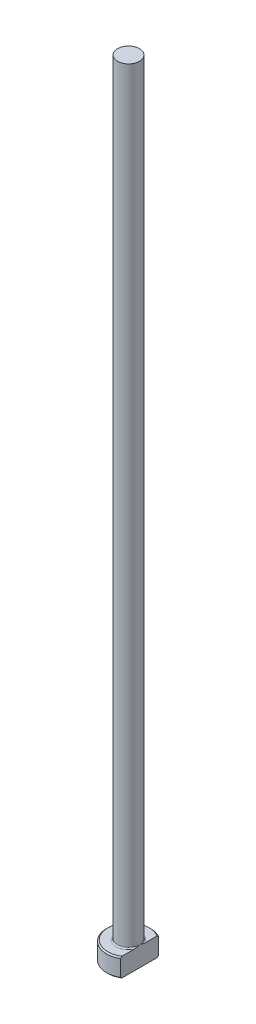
ISO-10303-21;
HEADER;
FILE_DESCRIPTION(('STEP AP214'),'2;1');
FILE_NAME('part.step','',(''),(''),'','','');
FILE_SCHEMA(('AUTOMOTIVE_DESIGN { 1 0 10303 214 1 1 1 1 }'));
ENDSEC;
DATA;
#1=APPLICATION_CONTEXT('core data for automotive mechanical design processes');
#2=APPLICATION_PROTOCOL_DEFINITION('international standard','automotive_design',2000,#1);
#3=PRODUCT_CONTEXT('',#1,'mechanical');
#4=PRODUCT('Part','Part','',(#3));
#5=PRODUCT_RELATED_PRODUCT_CATEGORY('part','',(#4));
#6=PRODUCT_DEFINITION_FORMATION('','',#4);
#7=PRODUCT_DEFINITION_CONTEXT('part definition',#1,'design');
#8=PRODUCT_DEFINITION('design','',#6,#7);
#9=PRODUCT_DEFINITION_SHAPE('','',#8);
#10=(LENGTH_UNIT() NAMED_UNIT(*) SI_UNIT(.MILLI.,.METRE.));
#11=(NAMED_UNIT(*) PLANE_ANGLE_UNIT() SI_UNIT($,.RADIAN.));
#12=(NAMED_UNIT(*) SI_UNIT($,.STERADIAN.) SOLID_ANGLE_UNIT());
#13=UNCERTAINTY_MEASURE_WITH_UNIT(LENGTH_MEASURE(1.E-05),#10,'distance_accuracy_value','');
#14=(GEOMETRIC_REPRESENTATION_CONTEXT(3) GLOBAL_UNCERTAINTY_ASSIGNED_CONTEXT((#13)) GLOBAL_UNIT_ASSIGNED_CONTEXT((#10,
#11,#12)) REPRESENTATION_CONTEXT('',''));
#15=CARTESIAN_POINT('',(0.,0.,0.));
#16=DIRECTION('',(0.,0.,1.));
#17=DIRECTION('',(1.,0.,0.));
#18=AXIS2_PLACEMENT_3D('',#15,#16,#17);
#19=CARTESIAN_POINT('',(0.,0.,0.));
#20=DIRECTION('',(0.,-1.,0.));
#21=DIRECTION('',(0.,0.,-1.));
#22=AXIS2_PLACEMENT_3D('',#19,#20,#21);
#23=PLANE('',#22);
#24=CARTESIAN_POINT('',(0.,0.,0.));
#25=DIRECTION('',(0.,-1.,0.));
#26=DIRECTION('',(0.,0.,-1.));
#27=AXIS2_PLACEMENT_3D('',#24,#25,#26);
#28=CIRCLE('',#27,3.29999999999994);
#29=CARTESIAN_POINT('',(1.74999999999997,0.,2.79776696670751));
#30=VERTEX_POINT('',#29);
#31=CARTESIAN_POINT('',(1.74999999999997,0.,-2.79776696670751));
#32=VERTEX_POINT('',#31);
#33=EDGE_CURVE('E98',#30,#32,#28,.T.);
#34=ORIENTED_EDGE('',*,*,#33,.T.);
#35=DIRECTION('',(0.,0.,1.));
#36=VECTOR('',#35,1.);
#37=CARTESIAN_POINT('',(1.74999999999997,0.,-3.03108891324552));
#38=LINE('',#37,#36);
#39=EDGE_CURVE('E83',#32,#30,#38,.T.);
#40=ORIENTED_EDGE('',*,*,#39,.T.);
#41=EDGE_LOOP('',(#34,#40));
#42=FACE_BOUND('',#41,.T.);
#43=ADVANCED_FACE('F32',(#42),#23,.T.);
#44=CARTESIAN_POINT('',(0.,259.958771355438,0.));
#45=DIRECTION('',(0.,1.,0.));
#46=DIRECTION('',(0.,0.,1.));
#47=AXIS2_PLACEMENT_3D('',#44,#45,#46);
#48=CYLINDRICAL_SURFACE('',#47,3.49999999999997);
#49=CARTESIAN_POINT('',(0.,2.80000000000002,0.));
#50=DIRECTION('',(0.,1.,0.));
#51=DIRECTION('',(0.,0.,1.));
#52=AXIS2_PLACEMENT_3D('',#49,#50,#51);
#53=CIRCLE('',#52,3.49999999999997);
#54=CARTESIAN_POINT('',(1.74999999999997,2.80000000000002,3.03108891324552));
#55=VERTEX_POINT('',#54);
#56=CARTESIAN_POINT('',(1.74999999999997,2.80000000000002,-3.03108891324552));
#57=VERTEX_POINT('',#56);
#58=EDGE_CURVE('E104',#55,#57,#53,.F.);
#59=ORIENTED_EDGE('',*,*,#58,.T.);
#60=DIRECTION('',(0.,-1.,0.));
#61=VECTOR('',#60,1.);
#62=CARTESIAN_POINT('',(1.74999999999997,125.,-3.03108891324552));
#63=LINE('',#62,#61);
#64=CARTESIAN_POINT('',(1.74999999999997,0.200000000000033,-3.03108891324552));
#65=VERTEX_POINT('',#64);
#66=EDGE_CURVE('E183',#57,#65,#63,.T.);
#67=ORIENTED_EDGE('',*,*,#66,.T.);
#68=CARTESIAN_POINT('',(0.,0.200000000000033,0.));
#69=DIRECTION('',(0.,-1.,0.));
#70=DIRECTION('',(0.,0.,-1.));
#71=AXIS2_PLACEMENT_3D('',#68,#69,#70);
#72=CIRCLE('',#71,3.49999999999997);
#73=CARTESIAN_POINT('',(1.74999999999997,0.200000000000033,3.03108891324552));
#74=VERTEX_POINT('',#73);
#75=EDGE_CURVE('E100',#65,#74,#72,.F.);
#76=ORIENTED_EDGE('',*,*,#75,.T.);
#77=DIRECTION('',(0.,-1.,0.));
#78=VECTOR('',#77,1.);
#79=CARTESIAN_POINT('',(1.74999999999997,125.,3.03108891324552));
#80=LINE('',#79,#78);
#81=EDGE_CURVE('E93',#55,#74,#80,.T.);
#82=ORIENTED_EDGE('',*,*,#81,.F.);
#83=EDGE_LOOP('',(#59,#67,#76,#82));
#84=FACE_BOUND('',#83,.T.);
#85=ADVANCED_FACE('F158',(#84),#48,.T.);
#86=CARTESIAN_POINT('',(-3.49999999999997,3.,0.));
#87=DIRECTION('',(0.,1.,0.));
#88=DIRECTION('',(0.,0.,1.));
#89=AXIS2_PLACEMENT_3D('',#86,#87,#88);
#90=PLANE('',#89);
#91=CARTESIAN_POINT('',(0.,3.,0.));
#92=DIRECTION('',(0.,1.,0.));
#93=DIRECTION('',(0.,0.,1.));
#94=AXIS2_PLACEMENT_3D('',#91,#92,#93);
#95=CIRCLE('',#94,3.29999999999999);
#96=CARTESIAN_POINT('',(1.74999999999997,3.,-2.79776696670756));
#97=VERTEX_POINT('',#96);
#98=CARTESIAN_POINT('',(1.74999999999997,3.,2.79776696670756));
#99=VERTEX_POINT('',#98);
#100=EDGE_CURVE('E178',#97,#99,#95,.T.);
#101=ORIENTED_EDGE('',*,*,#100,.T.);
#102=DIRECTION('',(0.,0.,-1.));
#103=VECTOR('',#102,1.);
#104=CARTESIAN_POINT('',(1.74999999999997,3.,0.));
#105=LINE('',#104,#103);
#106=CARTESIAN_POINT('',(1.74999999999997,2.99999999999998,0.860232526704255));
#107=VERTEX_POINT('',#106);
#108=EDGE_CURVE('E57',#99,#107,#105,.T.);
#109=ORIENTED_EDGE('',*,*,#108,.T.);
#110=CARTESIAN_POINT('',(0.,3.,0.));
#111=DIRECTION('',(0.,1.,0.));
#112=DIRECTION('',(0.,0.,1.));
#113=AXIS2_PLACEMENT_3D('',#110,#111,#112);
#114=CIRCLE('',#113,1.94999999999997);
#115=CARTESIAN_POINT('',(1.74999999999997,2.99999999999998,-0.860232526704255));
#116=VERTEX_POINT('',#115);
#117=EDGE_CURVE('E107',#107,#116,#114,.F.);
#118=ORIENTED_EDGE('',*,*,#117,.T.);
#119=EDGE_CURVE('E136',#116,#97,#105,.T.);
#120=ORIENTED_EDGE('',*,*,#119,.T.);
#121=EDGE_LOOP('',(#101,#109,#118,#120));
#122=FACE_BOUND('',#121,.T.);
#123=ADVANCED_FACE('F147',(#122),#90,.T.);
#124=CARTESIAN_POINT('',(0.,3.,0.));
#125=DIRECTION('',(0.,-1.,0.));
#126=DIRECTION('',(0.,0.,-1.));
#127=AXIS2_PLACEMENT_3D('',#124,#125,#126);
#128=CONICAL_SURFACE('',#127,3.29999999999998,0.785398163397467);
#129=ORIENTED_EDGE('',*,*,#58,.F.);
#130=CARTESIAN_POINT('',(1.74999999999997,-0.596308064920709,6.67057455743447));
#131=CARTESIAN_POINT('',(1.74999999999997,-0.450097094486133,6.51940719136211));
#132=CARTESIAN_POINT('',(1.74999999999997,-0.304043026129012,6.36808756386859));
#133=CARTESIAN_POINT('',(1.74999999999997,-0.0123415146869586,6.06505321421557));
#134=CARTESIAN_POINT('',(1.74999999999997,0.133305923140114,5.91333848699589));
#135=CARTESIAN_POINT('',(1.74999999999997,0.42417201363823,5.60934946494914));
#136=CARTESIAN_POINT('',(1.74999999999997,0.569390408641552,5.45707492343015));
#137=CARTESIAN_POINT('',(1.74999999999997,0.859185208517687,5.15191761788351));
#138=CARTESIAN_POINT('',(1.74999999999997,1.00376161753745,4.99903485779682));
#139=CARTESIAN_POINT('',(1.74999999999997,1.28922437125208,4.69552747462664));
#140=CARTESIAN_POINT('',(1.74999999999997,1.43012702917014,4.54491820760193));
#141=CARTESIAN_POINT('',(1.74999999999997,1.71087777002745,4.24272028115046));
#142=CARTESIAN_POINT('',(1.74999999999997,1.85072585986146,4.09113162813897));
#143=CARTESIAN_POINT('',(1.74999999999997,2.12895853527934,3.78667524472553));
#144=CARTESIAN_POINT('',(1.74999999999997,2.26734342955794,3.63380779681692));
#145=CARTESIAN_POINT('',(1.74999999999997,2.54209958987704,3.32627683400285));
#146=CARTESIAN_POINT('',(1.74999999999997,2.67847093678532,3.17161339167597));
#147=CARTESIAN_POINT('',(1.74999999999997,2.89617282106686,2.91990258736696));
#148=CARTESIAN_POINT('',(1.74999999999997,2.97843114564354,2.82365864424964));
#149=CARTESIAN_POINT('',(1.74999999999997,3.14148360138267,2.62991861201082));
#150=CARTESIAN_POINT('',(1.74999999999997,3.22227758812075,2.53242240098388));
#151=CARTESIAN_POINT('',(1.74999999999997,3.38274452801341,2.3347903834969));
#152=CARTESIAN_POINT('',(1.74999999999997,3.46239661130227,2.23463757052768));
#153=CARTESIAN_POINT('',(1.74999999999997,3.61891495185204,2.03220225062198));
#154=CARTESIAN_POINT('',(1.74999999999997,3.69578187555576,1.92992026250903));
#155=CARTESIAN_POINT('',(1.74999999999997,3.8466965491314,1.7209051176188));
#156=CARTESIAN_POINT('',(1.74999999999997,3.92068375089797,1.61412795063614));
#157=CARTESIAN_POINT('',(1.74999999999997,4.06269616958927,1.3963838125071));
#158=CARTESIAN_POINT('',(1.74999999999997,4.13071318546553,1.28541136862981));
#159=CARTESIAN_POINT('',(1.74999999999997,4.22516490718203,1.11561175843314));
#160=CARTESIAN_POINT('',(1.74999999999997,4.25522351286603,1.05881631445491));
#161=CARTESIAN_POINT('',(1.74999999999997,4.31237042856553,0.943756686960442));
#162=CARTESIAN_POINT('',(1.74999999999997,4.3394581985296,0.885492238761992));
#163=CARTESIAN_POINT('',(1.74999999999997,4.41499290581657,0.708569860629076));
#164=CARTESIAN_POINT('',(1.74999999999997,4.45796078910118,0.587356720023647));
#165=CARTESIAN_POINT('',(1.74999999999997,4.50447230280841,0.405622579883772));
#166=CARTESIAN_POINT('',(1.74999999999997,4.51680920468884,0.347327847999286));
#167=CARTESIAN_POINT('',(1.74999999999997,4.53592536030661,0.229813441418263));
#168=CARTESIAN_POINT('',(1.74999999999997,4.54270510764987,0.170593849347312));
#169=CARTESIAN_POINT('',(1.74999999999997,4.5502268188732,0.0519516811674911));
#170=CARTESIAN_POINT('',(1.74999999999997,4.55098747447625,-0.00746969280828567));
#171=CARTESIAN_POINT('',(1.74999999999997,4.54646541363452,-0.126082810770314));
#172=CARTESIAN_POINT('',(1.74999999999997,4.54118219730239,-0.18527453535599));
#173=CARTESIAN_POINT('',(1.74999999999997,4.52501178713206,-0.30235763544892));
#174=CARTESIAN_POINT('',(1.74999999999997,4.51417270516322,-0.360255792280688));
#175=CARTESIAN_POINT('',(1.74999999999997,4.48756668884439,-0.474896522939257));
#176=CARTESIAN_POINT('',(1.74999999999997,4.47179916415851,-0.531638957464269));
#177=CARTESIAN_POINT('',(1.74999999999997,4.43599695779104,-0.644103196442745));
#178=CARTESIAN_POINT('',(1.74999999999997,4.4159382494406,-0.69981725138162));
#179=CARTESIAN_POINT('',(1.74999999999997,4.37235913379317,-0.809843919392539));
#180=CARTESIAN_POINT('',(1.74999999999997,4.34883943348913,-0.864156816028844));
#181=CARTESIAN_POINT('',(1.74999999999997,4.27385837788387,-1.02562379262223));
#182=CARTESIAN_POINT('',(1.74999999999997,4.21814894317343,-1.13079943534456));
#183=CARTESIAN_POINT('',(1.74999999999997,4.09935726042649,-1.33694307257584));
#184=CARTESIAN_POINT('',(1.74999999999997,4.03626572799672,-1.43790554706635));
#185=CARTESIAN_POINT('',(1.74999999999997,3.90490246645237,-1.63694628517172));
#186=CARTESIAN_POINT('',(1.74999999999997,3.83661129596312,-1.73501160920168));
#187=CARTESIAN_POINT('',(1.74999999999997,3.69663576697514,-1.92859117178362));
#188=CARTESIAN_POINT('',(1.74999999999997,3.62495312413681,-2.02410666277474));
#189=CARTESIAN_POINT('',(1.74999999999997,3.47817312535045,-2.21448054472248));
#190=CARTESIAN_POINT('',(1.74999999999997,3.40304324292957,-2.30931373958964));
#191=CARTESIAN_POINT('',(1.74999999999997,3.25092223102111,-2.49748629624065));
#192=CARTESIAN_POINT('',(1.74999999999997,3.17393090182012,-2.59082549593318));
#193=CARTESIAN_POINT('',(1.74999999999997,3.0187358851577,-2.77610276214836));
#194=CARTESIAN_POINT('',(1.74999999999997,2.94053559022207,-2.86804367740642));
#195=CARTESIAN_POINT('',(1.74999999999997,2.78305359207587,-3.0509955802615));
#196=CARTESIAN_POINT('',(1.74999999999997,2.70377186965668,-3.14200655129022));
#197=CARTESIAN_POINT('',(1.74999999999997,2.49177755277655,-3.38307713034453));
#198=CARTESIAN_POINT('',(1.74999999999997,2.35832098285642,-3.53248201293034));
#199=CARTESIAN_POINT('',(1.74999999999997,2.08977689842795,-3.82982116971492));
#200=CARTESIAN_POINT('',(1.74999999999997,1.95468933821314,-3.97775540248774));
#201=CARTESIAN_POINT('',(1.74999999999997,1.68319766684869,-4.27266697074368));
#202=CARTESIAN_POINT('',(1.74999999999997,1.54679243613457,-4.41964327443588));
#203=CARTESIAN_POINT('',(1.74999999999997,1.27308598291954,-4.71275937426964));
#204=CARTESIAN_POINT('',(1.74999999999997,1.13578475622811,-4.85889916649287));
#205=CARTESIAN_POINT('',(1.74999999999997,0.734183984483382,-5.28435414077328));
#206=CARTESIAN_POINT('',(1.74999999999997,0.468971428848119,-5.56280727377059));
#207=CARTESIAN_POINT('',(1.74999999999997,0.0701049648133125,-5.97918348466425));
#208=CARTESIAN_POINT('',(1.74999999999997,-0.0629507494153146,-6.11768155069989));
#209=CARTESIAN_POINT('',(1.74999999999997,-0.32939522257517,-6.39435480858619));
#210=CARTESIAN_POINT('',(1.74999999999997,-0.462783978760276,-6.53253000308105));
#211=CARTESIAN_POINT('',(1.74999999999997,-0.596308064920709,-6.67057455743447));
#212=B_SPLINE_CURVE_WITH_KNOTS('',3,(#130,#131,#132,#133,#134,#135,#136,#137,#138,#139,#140,
#141,#142,#143,#144,#145,#146,#147,#148,#149,#150,#151,#152,#153,#154,#155,#156,#157,#158,#159,
#160,#161,#162,#163,#164,#165,#166,#167,#168,#169,#170,#171,#172,#173,#174,#175,#176,#177,#178,
#179,#180,#181,#182,#183,#184,#185,#186,#187,#188,#189,#190,#191,#192,#193,#194,#195,#196,#197,
#198,#199,#200,#201,#202,#203,#204,#205,#206,#207,#208,#209,#210,#211),.UNSPECIFIED.,.F.,.F.,(4,
2,2,2,2,2,2,2,2,2,2,2,2,2,2,2,2,2,2,2,2,2,2,2,2,2,2,2,2,2,2,2,2,2,2,2,2,2,2,2,4),(0.,
0.63092275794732,1.26185363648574,1.89310749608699,2.5243572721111,3.14308654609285,
3.76181177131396,4.38040374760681,4.99897081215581,5.37878108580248,5.75862861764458,
6.14249031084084,6.52625953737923,6.91585739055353,7.30598230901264,7.4986761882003,
7.69140503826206,8.07538783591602,8.25392686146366,8.43245002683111,8.61041858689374,
8.78840186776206,8.96486927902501,9.1413578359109,9.3188617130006,9.49632938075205,
9.8528627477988,10.209849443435,10.5682434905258,10.9264581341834,11.2893876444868,
11.6523562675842,12.014444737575,12.3765396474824,12.977513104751,13.5785034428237,
14.1800594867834,14.7816183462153,15.9352370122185,16.5114050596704,17.0875683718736),.UNSPECIFIED.);
#213=EDGE_CURVE('E135',#55,#99,#212,.T.);
#214=ORIENTED_EDGE('',*,*,#213,.T.);
#215=ORIENTED_EDGE('',*,*,#100,.F.);
#216=EDGE_CURVE('E127',#97,#57,#212,.T.);
#217=ORIENTED_EDGE('',*,*,#216,.T.);
#218=EDGE_LOOP('',(#129,#214,#215,#217));
#219=FACE_BOUND('',#218,.T.);
#220=ADVANCED_FACE('F143',(#219),#128,.T.);
#221=CARTESIAN_POINT('',(0.,0.200000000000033,0.));
#222=DIRECTION('',(0.,1.,0.));
#223=DIRECTION('',(0.,0.,1.));
#224=AXIS2_PLACEMENT_3D('',#221,#222,#223);
#225=CONICAL_SURFACE('',#224,3.49999999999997,0.78539816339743);
#226=ORIENTED_EDGE('',*,*,#75,.F.);
#227=CARTESIAN_POINT('',(1.74999999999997,3.59630806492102,-6.67057455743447));
#228=CARTESIAN_POINT('',(1.74999999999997,3.45009709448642,-6.5194071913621));
#229=CARTESIAN_POINT('',(1.74999999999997,3.30404302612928,-6.36808756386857));
#230=CARTESIAN_POINT('',(1.74999999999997,3.01234151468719,-6.06505321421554));
#231=CARTESIAN_POINT('',(1.74999999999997,2.8666940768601,-5.91333848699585));
#232=CARTESIAN_POINT('',(1.74999999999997,2.57582798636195,-5.60934946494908));
#233=CARTESIAN_POINT('',(1.74999999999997,2.43060959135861,-5.45707492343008));
#234=CARTESIAN_POINT('',(1.74999999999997,2.14081479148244,-5.15191761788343));
#235=CARTESIAN_POINT('',(1.74999999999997,1.99623838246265,-4.99903485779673));
#236=CARTESIAN_POINT('',(1.74999999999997,1.71077562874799,-4.69552747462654));
#237=CARTESIAN_POINT('',(1.74999999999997,1.56987297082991,-4.54491820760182));
#238=CARTESIAN_POINT('',(1.74999999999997,1.28912222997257,-4.24272028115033));
#239=CARTESIAN_POINT('',(1.74999999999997,1.14927414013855,-4.09113162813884));
#240=CARTESIAN_POINT('',(1.74999999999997,0.871041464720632,-3.78667524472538));
#241=CARTESIAN_POINT('',(1.74999999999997,0.732656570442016,-3.63380779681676));
#242=CARTESIAN_POINT('',(1.74999999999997,0.457900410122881,-3.32627683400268));
#243=CARTESIAN_POINT('',(1.74999999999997,0.321529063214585,-3.17161339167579));
#244=CARTESIAN_POINT('',(1.74999999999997,0.103827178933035,-2.91990258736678));
#245=CARTESIAN_POINT('',(1.74999999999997,0.0215688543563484,-2.82365864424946));
#246=CARTESIAN_POINT('',(1.74999999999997,-0.141483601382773,-2.62991861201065));
#247=CARTESIAN_POINT('',(1.74999999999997,-0.22227758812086,-2.53242240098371));
#248=CARTESIAN_POINT('',(1.74999999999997,-0.382744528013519,-2.33479038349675));
#249=CARTESIAN_POINT('',(1.74999999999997,-0.462396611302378,-2.23463757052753));
#250=CARTESIAN_POINT('',(1.74999999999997,-0.61891495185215,-2.03220225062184));
#251=CARTESIAN_POINT('',(1.74999999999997,-0.695781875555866,-1.9299202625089));
#252=CARTESIAN_POINT('',(1.74999999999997,-0.846696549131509,-1.72090511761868));
#253=CARTESIAN_POINT('',(1.74999999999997,-0.920683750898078,-1.61412795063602));
#254=CARTESIAN_POINT('',(1.74999999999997,-1.06269616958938,-1.39638381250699));
#255=CARTESIAN_POINT('',(1.74999999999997,-1.13071318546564,-1.2854113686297));
#256=CARTESIAN_POINT('',(1.74999999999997,-1.22516490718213,-1.11561175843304));
#257=CARTESIAN_POINT('',(1.74999999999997,-1.25522351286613,-1.05881631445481));
#258=CARTESIAN_POINT('',(1.74999999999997,-1.31237042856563,-0.943756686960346));
#259=CARTESIAN_POINT('',(1.74999999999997,-1.33945819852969,-0.885492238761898));
#260=CARTESIAN_POINT('',(1.74999999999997,-1.41499290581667,-0.708569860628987));
#261=CARTESIAN_POINT('',(1.74999999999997,-1.45796078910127,-0.587356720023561));
#262=CARTESIAN_POINT('',(1.74999999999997,-1.50447230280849,-0.405622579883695));
#263=CARTESIAN_POINT('',(1.74999999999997,-1.51680920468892,-0.347327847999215));
#264=CARTESIAN_POINT('',(1.74999999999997,-1.53592536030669,-0.229813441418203));
#265=CARTESIAN_POINT('',(1.74999999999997,-1.54270510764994,-0.170593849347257));
#266=CARTESIAN_POINT('',(1.74999999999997,-1.55022681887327,-0.0519516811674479));
#267=CARTESIAN_POINT('',(1.74999999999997,-1.55098747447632,0.00746969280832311));
#268=CARTESIAN_POINT('',(1.74999999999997,-1.54646541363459,0.126082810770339));
#269=CARTESIAN_POINT('',(1.74999999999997,-1.54118219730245,0.185274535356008));
#270=CARTESIAN_POINT('',(1.74999999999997,-1.52501178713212,0.302357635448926));
#271=CARTESIAN_POINT('',(1.74999999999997,-1.51417270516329,0.360255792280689));
#272=CARTESIAN_POINT('',(1.74999999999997,-1.48756668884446,0.474896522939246));
#273=CARTESIAN_POINT('',(1.74999999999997,-1.47179916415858,0.531638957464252));
#274=CARTESIAN_POINT('',(1.74999999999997,-1.43599695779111,0.644103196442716));
#275=CARTESIAN_POINT('',(1.74999999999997,-1.41593824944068,0.699817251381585));
#276=CARTESIAN_POINT('',(1.74999999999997,-1.37235913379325,0.809843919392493));
#277=CARTESIAN_POINT('',(1.74999999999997,-1.3488394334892,0.864156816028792));
#278=CARTESIAN_POINT('',(1.74999999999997,-1.27385837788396,1.02562379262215));
#279=CARTESIAN_POINT('',(1.74999999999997,-1.21814894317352,1.13079943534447));
#280=CARTESIAN_POINT('',(1.74999999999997,-1.09935726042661,1.33694307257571));
#281=CARTESIAN_POINT('',(1.74999999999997,-1.03626572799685,1.4379055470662));
#282=CARTESIAN_POINT('',(1.74999999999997,-0.904902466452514,1.63694628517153));
#283=CARTESIAN_POINT('',(1.74999999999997,-0.836611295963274,1.73501160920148));
#284=CARTESIAN_POINT('',(1.74999999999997,-0.696635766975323,1.92859117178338));
#285=CARTESIAN_POINT('',(1.74999999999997,-0.624953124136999,2.02410666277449));
#286=CARTESIAN_POINT('',(1.74999999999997,-0.478173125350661,2.2144805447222));
#287=CARTESIAN_POINT('',(1.74999999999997,-0.403043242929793,2.30931373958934));
#288=CARTESIAN_POINT('',(1.74999999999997,-0.250922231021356,2.49748629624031));
#289=CARTESIAN_POINT('',(1.74999999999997,-0.173930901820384,2.59082549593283));
#290=CARTESIAN_POINT('',(1.74999999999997,-0.0187358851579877,2.77610276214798));
#291=CARTESIAN_POINT('',(1.74999999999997,0.0594644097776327,2.86804367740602));
#292=CARTESIAN_POINT('',(1.74999999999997,0.216946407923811,3.05099558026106));
#293=CARTESIAN_POINT('',(1.74999999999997,0.296228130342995,3.14200655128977));
#294=CARTESIAN_POINT('',(1.74999999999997,0.508222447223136,3.38307713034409));
#295=CARTESIAN_POINT('',(1.74999999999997,0.64167901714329,3.53248201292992));
#296=CARTESIAN_POINT('',(1.74999999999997,0.910223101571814,3.82982116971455));
#297=CARTESIAN_POINT('',(1.74999999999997,1.04531066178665,3.97775540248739));
#298=CARTESIAN_POINT('',(1.74999999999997,1.31680233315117,4.27266697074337));
#299=CARTESIAN_POINT('',(1.74999999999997,1.45320756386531,4.41964327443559));
#300=CARTESIAN_POINT('',(1.74999999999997,1.72691401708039,4.7127593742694));
#301=CARTESIAN_POINT('',(1.74999999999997,1.86421524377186,4.85889916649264));
#302=CARTESIAN_POINT('',(1.74999999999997,2.26581601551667,5.2843541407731));
#303=CARTESIAN_POINT('',(1.74999999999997,2.53102857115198,5.56280727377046));
#304=CARTESIAN_POINT('',(1.74999999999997,2.92989503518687,5.97918348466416));
#305=CARTESIAN_POINT('',(1.74999999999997,3.06295074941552,6.11768155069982));
#306=CARTESIAN_POINT('',(1.74999999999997,3.32939522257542,6.39435480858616));
#307=CARTESIAN_POINT('',(1.74999999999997,3.46278397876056,6.53253000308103));
#308=CARTESIAN_POINT('',(1.74999999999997,3.59630806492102,6.67057455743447));
#309=B_SPLINE_CURVE_WITH_KNOTS('',3,(#227,#228,#229,#230,#231,#232,#233,#234,#235,#236,#237,
#238,#239,#240,#241,#242,#243,#244,#245,#246,#247,#248,#249,#250,#251,#252,#253,#254,#255,#256,
#257,#258,#259,#260,#261,#262,#263,#264,#265,#266,#267,#268,#269,#270,#271,#272,#273,#274,#275,
#276,#277,#278,#279,#280,#281,#282,#283,#284,#285,#286,#287,#288,#289,#290,#291,#292,#293,#294,
#295,#296,#297,#298,#299,#300,#301,#302,#303,#304,#305,#306,#307,#308),.UNSPECIFIED.,.F.,.F.,(4,
2,2,2,2,2,2,2,2,2,2,2,2,2,2,2,2,2,2,2,2,2,2,2,2,2,2,2,2,2,2,2,2,2,2,2,2,2,2,2,4),(0.,
0.630922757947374,1.26185363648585,1.89310749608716,2.52435727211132,3.14308654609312,
3.76181177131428,4.38040374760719,4.99897081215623,5.37878108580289,5.75862861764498,
6.14249031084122,6.5262595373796,6.91585739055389,7.30598230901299,7.49867618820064,
7.6914050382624,8.07538783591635,8.25392686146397,8.4324500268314,8.61041858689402,
8.78840186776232,8.96486927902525,9.14135783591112,9.3188617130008,9.49632938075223,
9.85286274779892,10.209849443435,10.5682434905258,10.9264581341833,11.2893876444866,
11.652356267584,12.0144447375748,12.3765396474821,12.9775131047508,13.5785034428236,
14.1800594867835,14.7816183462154,15.9352370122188,16.5114050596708,17.0875683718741),.UNSPECIFIED.);
#310=EDGE_CURVE('E86',#65,#32,#309,.T.);
#311=ORIENTED_EDGE('',*,*,#310,.T.);
#312=ORIENTED_EDGE('',*,*,#33,.F.);
#313=EDGE_CURVE('E89',#30,#74,#309,.T.);
#314=ORIENTED_EDGE('',*,*,#313,.T.);
#315=EDGE_LOOP('',(#226,#311,#312,#314));
#316=FACE_BOUND('',#315,.T.);
#317=ADVANCED_FACE('F97',(#316),#225,.T.);
#318=CARTESIAN_POINT('',(0.,3.19999999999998,0.));
#319=DIRECTION('',(0.,1.,0.));
#320=DIRECTION('',(0.,0.,1.));
#321=AXIS2_PLACEMENT_3D('',#318,#319,#320);
#322=TOROIDAL_SURFACE('',#321,1.94999999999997,0.2);
#323=CARTESIAN_POINT('',(1.74999999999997,3.19999999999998,0.));
#324=CARTESIAN_POINT('',(1.74999999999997,3.20000050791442,9.38679694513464E-11));
#325=CARTESIAN_POINT('',(1.74999999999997,3.20000101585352,-1.34501098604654E-07));
#326=CARTESIAN_POINT('',(1.74999999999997,3.20000198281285,-5.41283468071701E-07));
#327=CARTESIAN_POINT('',(1.74999999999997,3.20000243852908,-8.19487700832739E-07));
#328=CARTESIAN_POINT('',(1.74999999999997,3.20000335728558,-1.4843911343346E-06));
#329=CARTESIAN_POINT('',(1.74999999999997,3.20000381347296,-1.88052630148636E-06));
#330=CARTESIAN_POINT('',(1.74999999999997,3.20000466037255,-2.72280863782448E-06));
#331=CARTESIAN_POINT('',(1.74999999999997,3.20000505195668,-3.16812551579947E-06));
#332=CARTESIAN_POINT('',(1.74999999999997,3.20000641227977,-4.80772278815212E-06));
#333=CARTESIAN_POINT('',(1.74999999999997,3.20000730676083,-6.06508167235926E-06));
#334=CARTESIAN_POINT('',(1.74999999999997,3.20000885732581,-8.62364306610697E-06));
#335=CARTESIAN_POINT('',(1.74999999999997,3.20000952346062,-9.91907764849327E-06));
#336=CARTESIAN_POINT('',(1.74999999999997,3.20001212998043,-1.51310765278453E-05));
#337=CARTESIAN_POINT('',(1.74999999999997,3.20001395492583,-1.91092654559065E-05));
#338=CARTESIAN_POINT('',(1.74999999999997,3.2000168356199,-2.68327805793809E-05));
#339=CARTESIAN_POINT('',(1.74999999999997,3.20001795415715,-3.05551299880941E-05));
#340=CARTESIAN_POINT('',(1.74999999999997,3.20002287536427,-4.68261372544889E-05));
#341=CARTESIAN_POINT('',(1.74999999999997,3.20002674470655,-5.93446276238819E-05));
#342=CARTESIAN_POINT('',(1.74999999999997,3.20003278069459,-8.25255939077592E-05));
#343=CARTESIAN_POINT('',(1.74999999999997,3.20003512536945,-9.31393220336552E-05));
#344=CARTESIAN_POINT('',(1.74999999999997,3.20005413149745,-0.00017197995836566));
#345=CARTESIAN_POINT('',(1.74999999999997,3.20007897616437,-0.000237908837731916));
#346=CARTESIAN_POINT('',(1.74999999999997,3.20017305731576,-0.000496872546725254));
#347=CARTESIAN_POINT('',(1.74999999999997,3.20023617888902,-0.00069150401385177));
#348=CARTESIAN_POINT('',(1.74999999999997,3.20048774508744,-0.00145613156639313));
#349=CARTESIAN_POINT('',(1.74999999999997,3.20068259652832,-0.00202450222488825));
#350=CARTESIAN_POINT('',(1.74999999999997,3.20148279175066,-0.0043694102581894));
#351=CARTESIAN_POINT('',(1.74999999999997,3.20208089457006,-0.00614773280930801));
#352=CARTESIAN_POINT('',(1.74999999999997,3.20853845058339,-0.0253339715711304));
#353=CARTESIAN_POINT('',(1.74999999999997,3.21443574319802,-0.0427328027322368));
#354=CARTESIAN_POINT('',(1.74999999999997,3.22594434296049,-0.0768841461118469));
#355=CARTESIAN_POINT('',(1.74999999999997,3.2315579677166,-0.0936359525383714));
#356=CARTESIAN_POINT('',(1.74999999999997,3.24339960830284,-0.129193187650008));
#357=CARTESIAN_POINT('',(1.74999999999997,3.24961959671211,-0.148001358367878));
#358=CARTESIAN_POINT('',(1.74999999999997,3.26199268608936,-0.185858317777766));
#359=CARTESIAN_POINT('',(1.74999999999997,3.26814439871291,-0.204907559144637));
#360=CARTESIAN_POINT('',(1.74999999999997,3.28302129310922,-0.251728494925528));
#361=CARTESIAN_POINT('',(1.74999999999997,3.29164632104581,-0.279532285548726));
#362=CARTESIAN_POINT('',(1.74999999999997,3.30815507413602,-0.334622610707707));
#363=CARTESIAN_POINT('',(1.74999999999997,3.31605173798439,-0.361905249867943));
#364=CARTESIAN_POINT('',(1.74999999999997,3.33270110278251,-0.422187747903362));
#365=CARTESIAN_POINT('',(1.74999999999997,3.34130455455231,-0.4552293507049));
#366=CARTESIAN_POINT('',(1.74999999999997,3.35728256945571,-0.521873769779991));
#367=CARTESIAN_POINT('',(1.74999999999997,3.36464748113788,-0.555478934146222));
#368=CARTESIAN_POINT('',(1.74999999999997,3.37810121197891,-0.62522543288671));
#369=CARTESIAN_POINT('',(1.74999999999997,3.38407559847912,-0.661389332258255));
#370=CARTESIAN_POINT('',(1.74999999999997,3.39348021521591,-0.733973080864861));
#371=CARTESIAN_POINT('',(1.74999999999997,3.39691695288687,-0.770392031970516));
#372=CARTESIAN_POINT('',(1.74999999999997,3.39990626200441,-0.832262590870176));
#373=CARTESIAN_POINT('',(1.74999999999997,3.40032395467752,-0.85767040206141));
#374=CARTESIAN_POINT('',(1.74999999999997,3.39916217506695,-0.908260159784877));
#375=CARTESIAN_POINT('',(1.74999999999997,3.39759783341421,-0.933442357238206));
#376=CARTESIAN_POINT('',(1.74999999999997,3.39129859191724,-0.989903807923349));
#377=CARTESIAN_POINT('',(1.74999999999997,3.38586007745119,-1.02110925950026));
#378=CARTESIAN_POINT('',(1.74999999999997,3.36964168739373,-1.08216800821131));
#379=CARTESIAN_POINT('',(1.74999999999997,3.35888918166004,-1.11202738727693));
#380=CARTESIAN_POINT('',(1.74999999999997,3.33961802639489,-1.14878048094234));
#381=CARTESIAN_POINT('',(1.74999999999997,3.33455492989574,-1.15748014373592));
#382=CARTESIAN_POINT('',(1.74999999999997,3.32351587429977,-1.1742966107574));
#383=CARTESIAN_POINT('',(1.74999999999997,3.31753946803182,-1.18241312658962));
#384=CARTESIAN_POINT('',(1.74999999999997,3.30451428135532,-1.19787793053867));
#385=CARTESIAN_POINT('',(1.74999999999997,3.29745609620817,-1.20521842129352));
#386=CARTESIAN_POINT('',(1.74999999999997,3.2822352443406,-1.21865698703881));
#387=CARTESIAN_POINT('',(1.74999999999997,3.27407476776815,-1.22475746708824));
#388=CARTESIAN_POINT('',(1.74999999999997,3.25920166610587,-1.23370537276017));
#389=CARTESIAN_POINT('',(1.74999999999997,3.25274944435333,-1.23698363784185));
#390=CARTESIAN_POINT('',(1.74999999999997,3.23939659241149,-1.24245066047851));
#391=CARTESIAN_POINT('',(1.74999999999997,3.23249637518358,-1.2446404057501));
#392=CARTESIAN_POINT('',(1.74999999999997,3.21836445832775,-1.24776583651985));
#393=CARTESIAN_POINT('',(1.74999999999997,3.21113087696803,-1.24869317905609));
#394=CARTESIAN_POINT('',(1.74999999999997,3.19661788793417,-1.24917680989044));
#395=CARTESIAN_POINT('',(1.74999999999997,3.18933848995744,-1.2487333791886));
#396=CARTESIAN_POINT('',(1.74999999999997,3.17564813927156,-1.2466228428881));
#397=CARTESIAN_POINT('',(1.74999999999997,3.16921873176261,-1.24507159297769));
#398=CARTESIAN_POINT('',(1.74999999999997,3.1566813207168,-1.24099086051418));
#399=CARTESIAN_POINT('',(1.74999999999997,3.15057343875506,-1.23846101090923));
#400=CARTESIAN_POINT('',(1.74999999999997,3.13656990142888,-1.23147130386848));
#401=CARTESIAN_POINT('',(1.74999999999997,3.1288582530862,-1.2266435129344));
#402=CARTESIAN_POINT('',(1.74999999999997,3.11430996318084,-1.21581214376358));
#403=CARTESIAN_POINT('',(1.74999999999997,3.10747539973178,-1.20980585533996));
#404=CARTESIAN_POINT('',(1.74999999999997,3.09141283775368,-1.19367262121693));
#405=CARTESIAN_POINT('',(1.74999999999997,3.0827335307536,-1.18300273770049));
#406=CARTESIAN_POINT('',(1.74999999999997,3.06710756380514,-1.16049397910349));
#407=CARTESIAN_POINT('',(1.74999999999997,3.06016260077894,-1.14865397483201));
#408=CARTESIAN_POINT('',(1.74999999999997,3.04314403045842,-1.11526045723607));
#409=CARTESIAN_POINT('',(1.74999999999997,3.03452872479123,-1.09297031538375));
#410=CARTESIAN_POINT('',(1.74999999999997,3.0205187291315,-1.04724849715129));
#411=CARTESIAN_POINT('',(1.74999999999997,3.01515578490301,-1.02380790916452));
#412=CARTESIAN_POINT('',(1.74999999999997,3.00698483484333,-0.976403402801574));
#413=CARTESIAN_POINT('',(1.74999999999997,3.00418732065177,-0.952437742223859));
#414=CARTESIAN_POINT('',(1.74999999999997,3.00064912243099,-0.9043219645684));
#415=CARTESIAN_POINT('',(1.74999999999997,2.99991269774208,-0.880171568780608));
#416=CARTESIAN_POINT('',(1.74999999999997,3.00019275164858,-0.809643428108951));
#417=CARTESIAN_POINT('',(1.74999999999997,3.00344813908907,-0.763278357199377));
#418=CARTESIAN_POINT('',(1.74999999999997,3.01492484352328,-0.664825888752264));
#419=CARTESIAN_POINT('',(1.74999999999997,3.02376250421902,-0.612819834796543));
#420=CARTESIAN_POINT('',(1.74999999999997,3.04538488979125,-0.508370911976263));
#421=CARTESIAN_POINT('',(1.74999999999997,3.0582587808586,-0.455947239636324));
#422=CARTESIAN_POINT('',(1.74999999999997,3.08196429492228,-0.368604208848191));
#423=CARTESIAN_POINT('',(1.74999999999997,3.09211504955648,-0.333493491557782));
#424=CARTESIAN_POINT('',(1.74999999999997,3.11312724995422,-0.263893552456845));
#425=CARTESIAN_POINT('',(1.74999999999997,3.12397997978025,-0.229401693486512));
#426=CARTESIAN_POINT('',(1.74999999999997,3.1449667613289,-0.164340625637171));
#427=CARTESIAN_POINT('',(1.74999999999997,3.15504975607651,-0.133754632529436));
#428=CARTESIAN_POINT('',(1.74999999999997,3.17587821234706,-0.071424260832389));
#429=CARTESIAN_POINT('',(1.74999999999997,3.18663395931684,-0.0396831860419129));
#430=CARTESIAN_POINT('',(1.74999999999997,3.19791979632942,-0.0061453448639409));
#431=CARTESIAN_POINT('',(1.74999999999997,3.1985187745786,-0.00436467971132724));
#432=CARTESIAN_POINT('',(1.74999999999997,3.19931918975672,-0.00201922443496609));
#433=CARTESIAN_POINT('',(1.74999999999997,3.1995134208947,-0.00145265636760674));
#434=CARTESIAN_POINT('',(1.74999999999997,3.19976423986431,-0.000690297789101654));
#435=CARTESIAN_POINT('',(1.74999999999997,3.19982721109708,-0.000496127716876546));
#436=CARTESIAN_POINT('',(1.74999999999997,3.19992109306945,-0.000237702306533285));
#437=CARTESIAN_POINT('',(1.74999999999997,3.19994590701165,-0.000171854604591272));
#438=CARTESIAN_POINT('',(1.74999999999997,3.19996489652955,-9.31045536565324E-05));
#439=CARTESIAN_POINT('',(1.74999999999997,3.19996724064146,-8.24963335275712E-05));
#440=CARTESIAN_POINT('',(1.74999999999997,3.19997327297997,-5.93277760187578E-05));
#441=CARTESIAN_POINT('',(1.74999999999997,3.1999771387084,-4.68160427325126E-05));
#442=CARTESIAN_POINT('',(1.74999999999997,3.19998205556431,-3.05525841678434E-05));
#443=CARTESIAN_POINT('',(1.74999999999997,3.19998317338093,-2.68310310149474E-05));
#444=CARTESIAN_POINT('',(1.74999999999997,3.19998605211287,-1.91090650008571E-05));
#445=CARTESIAN_POINT('',(1.74999999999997,3.19998787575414,-1.51315953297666E-05));
#446=CARTESIAN_POINT('',(1.74999999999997,3.19999048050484,-9.92029969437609E-06));
#447=CARTESIAN_POINT('',(1.74999999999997,3.19999114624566,-8.62492588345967E-06));
#448=CARTESIAN_POINT('',(1.74999999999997,3.19999269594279,-6.06641152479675E-06));
#449=CARTESIAN_POINT('',(1.74999999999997,3.19999358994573,-4.80903333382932E-06));
#450=CARTESIAN_POINT('',(1.74999999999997,3.19999494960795,-3.16932189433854E-06));
#451=CARTESIAN_POINT('',(1.74999999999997,3.19999534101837,-2.72395382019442E-06));
#452=CARTESIAN_POINT('',(1.74999999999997,3.19999618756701,-1.88153780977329E-06));
#453=CARTESIAN_POINT('',(1.74999999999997,3.19999664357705,-1.48531958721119E-06));
#454=CARTESIAN_POINT('',(1.74999999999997,3.1999975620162,-8.20216861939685E-07));
#455=CARTESIAN_POINT('',(1.74999999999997,3.19999801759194,-5.41901808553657E-07));
#456=CARTESIAN_POINT('',(1.74999999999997,3.19999898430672,-1.34847126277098E-07));
#457=CARTESIAN_POINT('',(1.74999999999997,3.19999949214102,-9.38577158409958E-11));
#458=CARTESIAN_POINT('',(1.74999999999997,3.19999999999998,0.));
#459=B_SPLINE_CURVE_WITH_KNOTS('',3,(#323,#324,#325,#326,#327,#328,#329,#330,#331,#332,#333,
#334,#335,#336,#337,#338,#339,#340,#341,#342,#343,#344,#345,#346,#347,#348,#349,#350,#351,#352,
#353,#354,#355,#356,#357,#358,#359,#360,#361,#362,#363,#364,#365,#366,#367,#368,#369,#370,#371,
#372,#373,#374,#375,#376,#377,#378,#379,#380,#381,#382,#383,#384,#385,#386,#387,#388,#389,#390,
#391,#392,#393,#394,#395,#396,#397,#398,#399,#400,#401,#402,#403,#404,#405,#406,#407,#408,#409,
#410,#411,#412,#413,#414,#415,#416,#417,#418,#419,#420,#421,#422,#423,#424,#425,#426,#427,#428,
#429,#430,#431,#432,#433,#434,#435,#436,#437,#438,#439,#440,#441,#442,#443,#444,#445,#446,#447,
#448,#449,#450,#451,#452,#453,#454,#455,#456,#457,#458),.UNSPECIFIED.,.T.,.F.,(4,2,2,2,2,2,2,2,
2,2,2,2,2,2,2,2,2,2,2,2,2,2,2,2,2,2,2,2,2,2,2,2,2,2,2,2,2,2,2,2,2,2,2,2,2,2,2,2,2,2,2,2,2,2,2,2,
2,2,2,2,2,2,2,2,2,2,2,4),(0.,1.52538207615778E-06,3.12059533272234E-06,4.92466458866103E-06,
6.70193593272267E-06,1.13103009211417E-05,1.56767125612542E-05,2.8774065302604E-05,
4.0421459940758E-05,7.97265134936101E-05,0.00011230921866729,0.000323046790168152,
0.000937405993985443,0.0027392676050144,0.00836862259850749,0.0634773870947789,
0.116480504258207,0.175909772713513,0.235963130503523,0.32329152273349,0.408492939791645,
0.510903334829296,0.614078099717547,0.723976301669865,0.833591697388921,0.909765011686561,
0.985360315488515,1.08013194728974,1.1744204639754,1.20457287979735,1.23474010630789,
1.26518627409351,1.29557281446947,1.3172031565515,1.33881383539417,1.36056665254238,
1.38231501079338,1.40207044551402,1.42183329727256,1.44897527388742,1.47618041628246,
1.51721056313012,1.55828069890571,1.62957223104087,1.70154887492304,1.77381858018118,
1.84623752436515,1.98535010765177,2.1434225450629,2.30526751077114,2.41490365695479,
2.52337268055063,2.61998889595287,2.72052170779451,2.72615854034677,2.72795468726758,
2.72856758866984,2.72877806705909,2.72881063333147,2.72884991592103,2.7288615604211,
2.72887465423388,2.72887901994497,2.72888362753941,2.72888540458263,2.72888720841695,
2.72888880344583,2.72889032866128),.UNSPECIFIED.);
#460=CARTESIAN_POINT('',(1.74999999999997,3.19999999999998,0.));
#461=VERTEX_POINT('',#460);
#462=EDGE_CURVE('E11',#116,#461,#459,.T.);
#463=ORIENTED_EDGE('',*,*,#462,.F.);
#464=ORIENTED_EDGE('',*,*,#117,.F.);
#465=CARTESIAN_POINT('',(1.74999999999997,3.19999999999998,0.));
#466=CARTESIAN_POINT('',(1.74999999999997,3.19999949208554,-9.38679203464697E-11));
#467=CARTESIAN_POINT('',(1.74999999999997,3.19999898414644,1.34501098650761E-07));
#468=CARTESIAN_POINT('',(1.74999999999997,3.19999801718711,5.41283468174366E-07));
#469=CARTESIAN_POINT('',(1.74999999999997,3.19999756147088,8.1948770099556E-07));
#470=CARTESIAN_POINT('',(1.74999999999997,3.19999664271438,1.48439113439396E-06));
#471=CARTESIAN_POINT('',(1.74999999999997,3.19999618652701,1.88052630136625E-06));
#472=CARTESIAN_POINT('',(1.74999999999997,3.19999533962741,2.72280863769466E-06));
#473=CARTESIAN_POINT('',(1.74999999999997,3.19999494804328,3.16812551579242E-06));
#474=CARTESIAN_POINT('',(1.74999999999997,3.1999935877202,4.80772278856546E-06));
#475=CARTESIAN_POINT('',(1.74999999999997,3.19999269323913,6.06508167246E-06));
#476=CARTESIAN_POINT('',(1.74999999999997,3.19999114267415,8.62364306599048E-06));
#477=CARTESIAN_POINT('',(1.74999999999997,3.19999047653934,9.91907764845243E-06));
#478=CARTESIAN_POINT('',(1.74999999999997,3.19998787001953,1.51310765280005E-05));
#479=CARTESIAN_POINT('',(1.74999999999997,3.19998604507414,1.91092654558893E-05));
#480=CARTESIAN_POINT('',(1.74999999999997,3.19998316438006,2.68327805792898E-05));
#481=CARTESIAN_POINT('',(1.74999999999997,3.19998204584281,3.05551299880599E-05));
#482=CARTESIAN_POINT('',(1.74999999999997,3.19997712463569,4.68261372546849E-05));
#483=CARTESIAN_POINT('',(1.74999999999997,3.19997325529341,5.93446276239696E-05));
#484=CARTESIAN_POINT('',(1.74999999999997,3.19996721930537,8.25255939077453E-05));
#485=CARTESIAN_POINT('',(1.74999999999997,3.19996487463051,9.3139322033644E-05));
#486=CARTESIAN_POINT('',(1.74999999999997,3.19994586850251,0.000171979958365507));
#487=CARTESIAN_POINT('',(1.74999999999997,3.19992102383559,0.000237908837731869));
#488=CARTESIAN_POINT('',(1.74999999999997,3.1998269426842,0.000496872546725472));
#489=CARTESIAN_POINT('',(1.74999999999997,3.19976382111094,0.000691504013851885));
#490=CARTESIAN_POINT('',(1.74999999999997,3.19951225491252,0.00145613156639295));
#491=CARTESIAN_POINT('',(1.74999999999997,3.19931740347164,0.00202450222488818));
#492=CARTESIAN_POINT('',(1.74999999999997,3.1985172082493,0.00436941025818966));
#493=CARTESIAN_POINT('',(1.74999999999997,3.1979191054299,0.00614773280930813));
#494=CARTESIAN_POINT('',(1.74999999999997,3.19146154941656,0.0253339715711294));
#495=CARTESIAN_POINT('',(1.74999999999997,3.18556425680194,0.0427328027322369));
#496=CARTESIAN_POINT('',(1.74999999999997,3.17405565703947,0.0768841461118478));
#497=CARTESIAN_POINT('',(1.74999999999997,3.16844203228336,0.0936359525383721));
#498=CARTESIAN_POINT('',(1.74999999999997,3.15660039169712,0.129193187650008));
#499=CARTESIAN_POINT('',(1.74999999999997,3.15038040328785,0.148001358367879));
#500=CARTESIAN_POINT('',(1.74999999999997,3.1380073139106,0.185858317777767));
#501=CARTESIAN_POINT('',(1.74999999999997,3.13185560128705,0.204907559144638));
#502=CARTESIAN_POINT('',(1.74999999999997,3.11697870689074,0.251728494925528));
#503=CARTESIAN_POINT('',(1.74999999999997,3.10835367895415,0.279532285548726));
#504=CARTESIAN_POINT('',(1.74999999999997,3.09184492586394,0.334622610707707));
#505=CARTESIAN_POINT('',(1.74999999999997,3.08394826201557,0.361905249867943));
#506=CARTESIAN_POINT('',(1.74999999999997,3.06729889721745,0.422187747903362));
#507=CARTESIAN_POINT('',(1.74999999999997,3.05869544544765,0.4552293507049));
#508=CARTESIAN_POINT('',(1.74999999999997,3.04271743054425,0.521873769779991));
#509=CARTESIAN_POINT('',(1.74999999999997,3.03535251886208,0.555478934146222));
#510=CARTESIAN_POINT('',(1.74999999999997,3.02189878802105,0.62522543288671));
#511=CARTESIAN_POINT('',(1.74999999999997,3.01592440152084,0.661389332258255));
#512=CARTESIAN_POINT('',(1.74999999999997,3.00651978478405,0.733973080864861));
#513=CARTESIAN_POINT('',(1.74999999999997,3.00308304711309,0.770392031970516));
#514=CARTESIAN_POINT('',(1.74999999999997,3.00009373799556,0.832262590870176));
#515=CARTESIAN_POINT('',(1.74999999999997,2.99967604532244,0.85767040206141));
#516=CARTESIAN_POINT('',(1.74999999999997,3.00083782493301,0.908260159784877));
#517=CARTESIAN_POINT('',(1.74999999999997,3.00240216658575,0.933442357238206));
#518=CARTESIAN_POINT('',(1.74999999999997,3.00870140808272,0.989903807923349));
#519=CARTESIAN_POINT('',(1.74999999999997,3.01413992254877,1.02110925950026));
#520=CARTESIAN_POINT('',(1.74999999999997,3.03035831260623,1.08216800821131));
#521=CARTESIAN_POINT('',(1.74999999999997,3.04111081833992,1.11202738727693));
#522=CARTESIAN_POINT('',(1.74999999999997,3.06038197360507,1.14878048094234));
#523=CARTESIAN_POINT('',(1.74999999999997,3.06544507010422,1.15748014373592));
#524=CARTESIAN_POINT('',(1.74999999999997,3.07648412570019,1.1742966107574));
#525=CARTESIAN_POINT('',(1.74999999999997,3.08246053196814,1.18241312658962));
#526=CARTESIAN_POINT('',(1.74999999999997,3.09548571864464,1.19787793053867));
#527=CARTESIAN_POINT('',(1.74999999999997,3.10254390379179,1.20521842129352));
#528=CARTESIAN_POINT('',(1.74999999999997,3.11776475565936,1.21865698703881));
#529=CARTESIAN_POINT('',(1.74999999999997,3.12592523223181,1.22475746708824));
#530=CARTESIAN_POINT('',(1.74999999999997,3.14079833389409,1.23370537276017));
#531=CARTESIAN_POINT('',(1.74999999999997,3.14725055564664,1.23698363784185));
#532=CARTESIAN_POINT('',(1.74999999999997,3.16060340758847,1.24245066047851));
#533=CARTESIAN_POINT('',(1.74999999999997,3.16750362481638,1.2446404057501));
#534=CARTESIAN_POINT('',(1.74999999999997,3.18163554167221,1.24776583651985));
#535=CARTESIAN_POINT('',(1.74999999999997,3.18886912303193,1.24869317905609));
#536=CARTESIAN_POINT('',(1.74999999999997,3.20338211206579,1.24917680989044));
#537=CARTESIAN_POINT('',(1.74999999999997,3.21066151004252,1.2487333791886));
#538=CARTESIAN_POINT('',(1.74999999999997,3.2243518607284,1.2466228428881));
#539=CARTESIAN_POINT('',(1.74999999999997,3.23078126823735,1.24507159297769));
#540=CARTESIAN_POINT('',(1.74999999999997,3.24331867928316,1.24099086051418));
#541=CARTESIAN_POINT('',(1.74999999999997,3.2494265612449,1.23846101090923));
#542=CARTESIAN_POINT('',(1.74999999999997,3.26343009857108,1.23147130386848));
#543=CARTESIAN_POINT('',(1.74999999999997,3.27114174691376,1.2266435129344));
#544=CARTESIAN_POINT('',(1.74999999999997,3.28569003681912,1.21581214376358));
#545=CARTESIAN_POINT('',(1.74999999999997,3.29252460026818,1.20980585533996));
#546=CARTESIAN_POINT('',(1.74999999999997,3.30858716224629,1.19367262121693));
#547=CARTESIAN_POINT('',(1.74999999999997,3.31726646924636,1.18300273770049));
#548=CARTESIAN_POINT('',(1.74999999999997,3.33289243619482,1.16049397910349));
#549=CARTESIAN_POINT('',(1.74999999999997,3.33983739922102,1.14865397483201));
#550=CARTESIAN_POINT('',(1.74999999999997,3.35685596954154,1.11526045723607));
#551=CARTESIAN_POINT('',(1.74999999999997,3.36547127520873,1.09297031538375));
#552=CARTESIAN_POINT('',(1.74999999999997,3.37948127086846,1.04724849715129));
#553=CARTESIAN_POINT('',(1.74999999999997,3.38484421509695,1.02380790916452));
#554=CARTESIAN_POINT('',(1.74999999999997,3.39301516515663,0.976403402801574));
#555=CARTESIAN_POINT('',(1.74999999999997,3.39581267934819,0.952437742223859));
#556=CARTESIAN_POINT('',(1.74999999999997,3.39935087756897,0.9043219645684));
#557=CARTESIAN_POINT('',(1.74999999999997,3.40008730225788,0.880171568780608));
#558=CARTESIAN_POINT('',(1.74999999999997,3.39980724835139,0.809643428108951));
#559=CARTESIAN_POINT('',(1.74999999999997,3.3965518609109,0.763278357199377));
#560=CARTESIAN_POINT('',(1.74999999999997,3.38507515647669,0.664825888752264));
#561=CARTESIAN_POINT('',(1.74999999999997,3.37623749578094,0.612819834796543));
#562=CARTESIAN_POINT('',(1.74999999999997,3.35461511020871,0.508370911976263));
#563=CARTESIAN_POINT('',(1.74999999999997,3.34174121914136,0.455947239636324));
#564=CARTESIAN_POINT('',(1.74999999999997,3.31803570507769,0.368604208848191));
#565=CARTESIAN_POINT('',(1.74999999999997,3.30788495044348,0.333493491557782));
#566=CARTESIAN_POINT('',(1.74999999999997,3.28687275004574,0.263893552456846));
#567=CARTESIAN_POINT('',(1.74999999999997,3.27602002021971,0.229401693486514));
#568=CARTESIAN_POINT('',(1.74999999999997,3.25503323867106,0.164340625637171));
#569=CARTESIAN_POINT('',(1.74999999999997,3.24495024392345,0.133754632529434));
#570=CARTESIAN_POINT('',(1.74999999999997,3.22412178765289,0.0714242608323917));
#571=CARTESIAN_POINT('',(1.74999999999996,3.21336604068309,0.0396831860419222));
#572=CARTESIAN_POINT('',(1.74999999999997,3.20208020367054,0.00614534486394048));
#573=CARTESIAN_POINT('',(1.74999999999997,3.20148122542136,0.00436467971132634));
#574=CARTESIAN_POINT('',(1.74999999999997,3.20068081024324,0.00201922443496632));
#575=CARTESIAN_POINT('',(1.74999999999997,3.20048657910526,0.00145265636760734));
#576=CARTESIAN_POINT('',(1.74999999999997,3.20023576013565,0.000690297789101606));
#577=CARTESIAN_POINT('',(1.74999999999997,3.20017278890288,0.000496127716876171));
#578=CARTESIAN_POINT('',(1.74999999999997,3.20007890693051,0.000237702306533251));
#579=CARTESIAN_POINT('',(1.74999999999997,3.20005409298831,0.000171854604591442));
#580=CARTESIAN_POINT('',(1.74999999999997,3.20003510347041,9.3104553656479E-05));
#581=CARTESIAN_POINT('',(1.74999999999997,3.20003275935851,8.24963335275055E-05));
#582=CARTESIAN_POINT('',(1.74999999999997,3.20002672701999,5.93277760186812E-05));
#583=CARTESIAN_POINT('',(1.74999999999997,3.20002286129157,4.68160427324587E-05));
#584=CARTESIAN_POINT('',(1.74999999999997,3.20001794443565,3.05525841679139E-05));
#585=CARTESIAN_POINT('',(1.74999999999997,3.20001682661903,2.6831031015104E-05));
#586=CARTESIAN_POINT('',(1.74999999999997,3.20001394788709,1.91090650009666E-05));
#587=CARTESIAN_POINT('',(1.74999999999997,3.20001212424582,1.51315953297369E-05));
#588=CARTESIAN_POINT('',(1.74999999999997,3.20000951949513,9.92029969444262E-06));
#589=CARTESIAN_POINT('',(1.74999999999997,3.2000088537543,8.62492588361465E-06));
#590=CARTESIAN_POINT('',(1.74999999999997,3.20000730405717,6.06641152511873E-06));
#591=CARTESIAN_POINT('',(1.74999999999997,3.20000641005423,4.80903333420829E-06));
#592=CARTESIAN_POINT('',(1.74999999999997,3.20000505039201,3.16932189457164E-06));
#593=CARTESIAN_POINT('',(1.74999999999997,3.2000046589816,2.72395382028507E-06));
#594=CARTESIAN_POINT('',(1.74999999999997,3.20000381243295,1.88153780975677E-06));
#595=CARTESIAN_POINT('',(1.74999999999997,3.20000335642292,1.48531958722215E-06));
#596=CARTESIAN_POINT('',(1.74999999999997,3.20000243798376,8.20216861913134E-07));
#597=CARTESIAN_POINT('',(1.74999999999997,3.20000198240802,5.41901808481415E-07));
#598=CARTESIAN_POINT('',(1.74999999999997,3.20000101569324,1.3484712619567E-07));
#599=CARTESIAN_POINT('',(1.74999999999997,3.20000050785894,9.38576667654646E-11));
#600=CARTESIAN_POINT('',(1.74999999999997,3.19999999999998,0.));
#601=B_SPLINE_CURVE_WITH_KNOTS('',3,(#465,#466,#467,#468,#469,#470,#471,#472,#473,#474,#475,
#476,#477,#478,#479,#480,#481,#482,#483,#484,#485,#486,#487,#488,#489,#490,#491,#492,#493,#494,
#495,#496,#497,#498,#499,#500,#501,#502,#503,#504,#505,#506,#507,#508,#509,#510,#511,#512,#513,
#514,#515,#516,#517,#518,#519,#520,#521,#522,#523,#524,#525,#526,#527,#528,#529,#530,#531,#532,
#533,#534,#535,#536,#537,#538,#539,#540,#541,#542,#543,#544,#545,#546,#547,#548,#549,#550,#551,
#552,#553,#554,#555,#556,#557,#558,#559,#560,#561,#562,#563,#564,#565,#566,#567,#568,#569,#570,
#571,#572,#573,#574,#575,#576,#577,#578,#579,#580,#581,#582,#583,#584,#585,#586,#587,#588,#589,
#590,#591,#592,#593,#594,#595,#596,#597,#598,#599,#600),.UNSPECIFIED.,.T.,.F.,(4,2,2,2,2,2,2,2,
2,2,2,2,2,2,2,2,2,2,2,2,2,2,2,2,2,2,2,2,2,2,2,2,2,2,2,2,2,2,2,2,2,2,2,2,2,2,2,2,2,2,2,2,2,2,2,2,
2,2,2,2,2,2,2,2,2,2,2,4),(0.,1.52538207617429E-06,3.12059533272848E-06,4.92466458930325E-06,
6.70193593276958E-06,1.13103009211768E-05,1.56767125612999E-05,2.87740653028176E-05,
4.04214599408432E-05,7.97265134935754E-05,0.000112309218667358,0.000323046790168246,
0.000937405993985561,0.00273926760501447,0.00836862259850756,0.0634773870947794,
0.116480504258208,0.175909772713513,0.235963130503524,0.32329152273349,0.408492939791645,
0.510903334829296,0.614078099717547,0.723976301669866,0.833591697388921,0.909765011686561,
0.985360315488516,1.08013194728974,1.1744204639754,1.20457287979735,1.23474010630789,
1.26518627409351,1.29557281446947,1.3172031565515,1.33881383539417,1.36056665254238,
1.38231501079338,1.40207044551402,1.42183329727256,1.44897527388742,1.47618041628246,
1.51721056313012,1.55828069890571,1.62957223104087,1.70154887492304,1.77381858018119,
1.84623752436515,1.98535010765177,2.1434225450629,2.30526751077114,2.41490365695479,
2.52337268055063,2.61998889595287,2.72052170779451,2.72615854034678,2.72795468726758,
2.72856758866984,2.72877806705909,2.72881063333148,2.72884991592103,2.7288615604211,
2.72887465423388,2.72887901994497,2.72888362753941,2.72888540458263,2.72888720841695,
2.72888880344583,2.72889032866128),.UNSPECIFIED.);
#602=EDGE_CURVE('E46',#461,#107,#601,.T.);
#603=ORIENTED_EDGE('',*,*,#602,.F.);
#604=CARTESIAN_POINT('',(0.,3.19999999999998,0.));
#605=DIRECTION('',(0.,1.,0.));
#606=DIRECTION('',(0.,0.,1.));
#607=AXIS2_PLACEMENT_3D('',#604,#605,#606);
#608=CIRCLE('',#607,1.74999999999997);
#609=EDGE_CURVE('E103',#461,#461,#608,.T.);
#610=ORIENTED_EDGE('',*,*,#609,.F.);
#611=EDGE_LOOP('',(#463,#464,#603,#610));
#612=FACE_BOUND('',#611,.T.);
#613=ADVANCED_FACE('F34',(#612),#322,.F.);
#614=CARTESIAN_POINT('',(0.,259.958771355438,0.));
#615=DIRECTION('',(0.,1.,0.));
#616=DIRECTION('',(0.,0.,1.));
#617=AXIS2_PLACEMENT_3D('',#614,#615,#616);
#618=CYLINDRICAL_SURFACE('',#617,1.74999999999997);
#619=ORIENTED_EDGE('',*,*,#609,.T.);
#620=EDGE_LOOP('',(#619));
#621=FACE_BOUND('',#620,.T.);
#622=CARTESIAN_POINT('',(0.,125.,0.));
#623=DIRECTION('',(0.,1.,0.));
#624=DIRECTION('',(0.,0.,1.));
#625=AXIS2_PLACEMENT_3D('',#622,#623,#624);
#626=CIRCLE('',#625,1.74999999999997);
#627=CARTESIAN_POINT('',(0.,125.,1.74999999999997));
#628=VERTEX_POINT('',#627);
#629=EDGE_CURVE('E101',#628,#628,#626,.T.);
#630=ORIENTED_EDGE('',*,*,#629,.F.);
#631=EDGE_LOOP('',(#630));
#632=FACE_BOUND('',#631,.T.);
#633=ADVANCED_FACE('F155',(#621,#632),#618,.T.);
#634=CARTESIAN_POINT('',(-1.74999999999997,125.,0.));
#635=DIRECTION('',(0.,1.,0.));
#636=DIRECTION('',(0.,0.,1.));
#637=AXIS2_PLACEMENT_3D('',#634,#635,#636);
#638=PLANE('',#637);
#639=ORIENTED_EDGE('',*,*,#629,.T.);
#640=EDGE_LOOP('',(#639));
#641=FACE_BOUND('',#640,.T.);
#642=ADVANCED_FACE('F121',(#641),#638,.T.);
#643=CARTESIAN_POINT('',(1.74999999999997,125.,-3.03108891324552));
#644=DIRECTION('',(1.,0.,0.));
#645=DIRECTION('',(0.,0.,-1.));
#646=AXIS2_PLACEMENT_3D('',#643,#644,#645);
#647=PLANE('',#646);
#648=ORIENTED_EDGE('',*,*,#66,.F.);
#649=ORIENTED_EDGE('',*,*,#216,.F.);
#650=ORIENTED_EDGE('',*,*,#119,.F.);
#651=ORIENTED_EDGE('',*,*,#462,.T.);
#652=ORIENTED_EDGE('',*,*,#602,.T.);
#653=ORIENTED_EDGE('',*,*,#108,.F.);
#654=ORIENTED_EDGE('',*,*,#213,.F.);
#655=ORIENTED_EDGE('',*,*,#81,.T.);
#656=ORIENTED_EDGE('',*,*,#313,.F.);
#657=ORIENTED_EDGE('',*,*,#39,.F.);
#658=ORIENTED_EDGE('',*,*,#310,.F.);
#659=EDGE_LOOP('',(#648,#649,#650,#651,#652,#653,#654,#655,#656,#657,#658));
#660=FACE_BOUND('',#659,.T.);
#661=ADVANCED_FACE('F85',(#660),#647,.T.);
#662=CLOSED_SHELL('',(#43,#85,#123,#220,#317,#613,#633,#642,#661));
#663=MANIFOLD_SOLID_BREP('B2',#662);
#664=ADVANCED_BREP_SHAPE_REPRESENTATION('',(#18,#663),#14);
#665=SHAPE_DEFINITION_REPRESENTATION(#9,#664);
ENDSEC;
END-ISO-10303-21;
